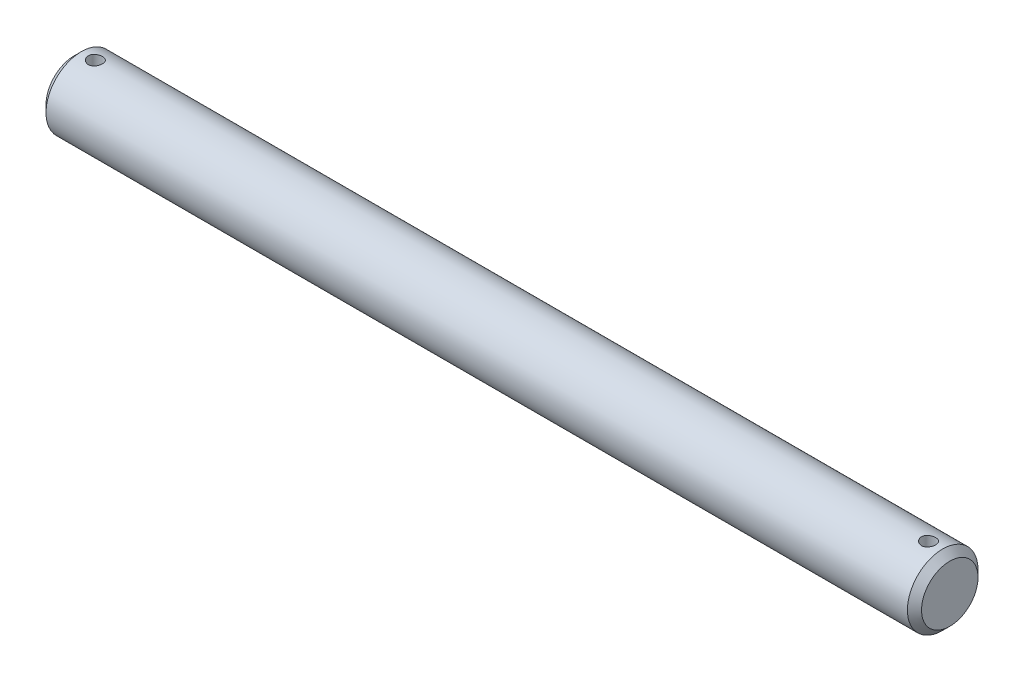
ISO-10303-21;
HEADER;
FILE_DESCRIPTION(('STEP AP214'),'2;1');
FILE_NAME('part.step','',(''),(''),'','','');
FILE_SCHEMA(('AUTOMOTIVE_DESIGN { 1 0 10303 214 1 1 1 1 }'));
ENDSEC;
DATA;
#1=APPLICATION_CONTEXT('core data for automotive mechanical design processes');
#2=APPLICATION_PROTOCOL_DEFINITION('international standard','automotive_design',2000,#1);
#3=PRODUCT_CONTEXT('',#1,'mechanical');
#4=PRODUCT('Part','Part','',(#3));
#5=PRODUCT_RELATED_PRODUCT_CATEGORY('part','',(#4));
#6=PRODUCT_DEFINITION_FORMATION('','',#4);
#7=PRODUCT_DEFINITION_CONTEXT('part definition',#1,'design');
#8=PRODUCT_DEFINITION('design','',#6,#7);
#9=PRODUCT_DEFINITION_SHAPE('','',#8);
#10=(LENGTH_UNIT() NAMED_UNIT(*) SI_UNIT(.MILLI.,.METRE.));
#11=(NAMED_UNIT(*) PLANE_ANGLE_UNIT() SI_UNIT($,.RADIAN.));
#12=(NAMED_UNIT(*) SI_UNIT($,.STERADIAN.) SOLID_ANGLE_UNIT());
#13=UNCERTAINTY_MEASURE_WITH_UNIT(LENGTH_MEASURE(1.E-05),#10,'distance_accuracy_value','');
#14=(GEOMETRIC_REPRESENTATION_CONTEXT(3) GLOBAL_UNCERTAINTY_ASSIGNED_CONTEXT((#13)) GLOBAL_UNIT_ASSIGNED_CONTEXT((#10,
#11,#12)) REPRESENTATION_CONTEXT('',''));
#15=CARTESIAN_POINT('',(0.,0.,0.));
#16=DIRECTION('',(0.,0.,1.));
#17=DIRECTION('',(1.,0.,0.));
#18=AXIS2_PLACEMENT_3D('',#15,#16,#17);
#19=CARTESIAN_POINT('',(1240.,0.,0.));
#20=DIRECTION('',(-1.,0.,0.));
#21=DIRECTION('',(0.,0.,1.));
#22=AXIS2_PLACEMENT_3D('',#19,#20,#21);
#23=CYLINDRICAL_SURFACE('',#22,50.);
#24=CARTESIAN_POINT('',(1230.,0.,0.));
#25=DIRECTION('',(1.,0.,0.));
#26=DIRECTION('',(0.,0.,-1.));
#27=AXIS2_PLACEMENT_3D('',#24,#25,#26);
#28=CIRCLE('',#27,50.);
#29=CARTESIAN_POINT('',(1230.,0.,-50.));
#30=VERTEX_POINT('',#29);
#31=EDGE_CURVE('E53',#30,#30,#28,.F.);
#32=ORIENTED_EDGE('',*,*,#31,.T.);
#33=EDGE_LOOP('',(#32));
#34=FACE_BOUND('',#33,.T.);
#35=CARTESIAN_POINT('',(10.,0.,0.));
#36=DIRECTION('',(1.,0.,0.));
#37=DIRECTION('',(0.,0.,-1.));
#38=AXIS2_PLACEMENT_3D('',#35,#36,#37);
#39=CIRCLE('',#38,50.);
#40=CARTESIAN_POINT('',(10.,0.,-50.));
#41=VERTEX_POINT('',#40);
#42=EDGE_CURVE('E58',#41,#41,#39,.T.);
#43=ORIENTED_EDGE('',*,*,#42,.T.);
#44=EDGE_LOOP('',(#43));
#45=FACE_BOUND('',#44,.T.);
#46=CARTESIAN_POINT('',(20.,-50.,0.));
#47=CARTESIAN_POINT('',(19.9999944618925,-50.0000028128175,0.277977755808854));
#48=CARTESIAN_POINT('',(20.011593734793,-49.9976778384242,0.555886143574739));
#49=CARTESIAN_POINT('',(20.0578879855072,-49.9884489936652,1.10977921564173));
#50=CARTESIAN_POINT('',(20.0925868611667,-49.9815443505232,1.38576356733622));
#51=CARTESIAN_POINT('',(20.1848451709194,-49.963338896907,1.93392208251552));
#52=CARTESIAN_POINT('',(20.2424203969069,-49.9520350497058,2.20609347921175));
#53=CARTESIAN_POINT('',(20.379977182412,-49.9253471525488,2.74451501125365));
#54=CARTESIAN_POINT('',(20.4599591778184,-49.9099630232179,3.01076503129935));
#55=CARTESIAN_POINT('',(20.6416238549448,-49.875557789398,3.53521359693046));
#56=CARTESIAN_POINT('',(20.7432850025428,-49.8565402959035,3.79341984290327));
#57=CARTESIAN_POINT('',(20.9675961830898,-49.8153808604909,4.30028962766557));
#58=CARTESIAN_POINT('',(21.0902464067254,-49.7932388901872,4.54895307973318));
#59=CARTESIAN_POINT('',(21.3556138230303,-49.7464407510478,5.03500105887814));
#60=CARTESIAN_POINT('',(21.4983261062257,-49.7217851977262,5.27238832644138));
#61=CARTESIAN_POINT('',(21.8028865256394,-49.6706164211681,5.73445047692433));
#62=CARTESIAN_POINT('',(21.9647409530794,-49.6441025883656,5.95912114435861));
#63=CARTESIAN_POINT('',(22.3084890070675,-49.5896179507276,6.39679707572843));
#64=CARTESIAN_POINT('',(22.490599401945,-49.5616335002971,6.60963041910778));
#65=CARTESIAN_POINT('',(22.8719972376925,-49.5052811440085,7.01925151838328));
#66=CARTESIAN_POINT('',(23.0712848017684,-49.4769132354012,7.21603915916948));
#67=CARTESIAN_POINT('',(23.485742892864,-49.4205766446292,7.59228605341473));
#68=CARTESIAN_POINT('',(23.7009174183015,-49.3926080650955,7.77174091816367));
#69=CARTESIAN_POINT('',(24.1455810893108,-49.3378715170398,8.11197405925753));
#70=CARTESIAN_POINT('',(24.3750652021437,-49.3111031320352,8.27275884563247));
#71=CARTESIAN_POINT('',(24.8490688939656,-49.2592741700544,8.57600136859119));
#72=CARTESIAN_POINT('',(25.0937084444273,-49.2342317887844,8.71827477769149));
#73=CARTESIAN_POINT('',(25.5943753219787,-49.1868624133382,8.98167482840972));
#74=CARTESIAN_POINT('',(25.8504027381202,-49.1645354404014,9.10280130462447));
#75=CARTESIAN_POINT('',(26.3720234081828,-49.1232596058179,9.32297805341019));
#76=CARTESIAN_POINT('',(26.6376159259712,-49.1043104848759,9.42203002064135));
#77=CARTESIAN_POINT('',(27.1764793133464,-49.0703574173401,9.59729126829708));
#78=CARTESIAN_POINT('',(27.4497500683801,-49.0553534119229,9.67350088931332));
#79=CARTESIAN_POINT('',(27.9983544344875,-49.0299142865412,9.80161813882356));
#80=CARTESIAN_POINT('',(28.2736140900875,-49.019421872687,9.85383113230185));
#81=CARTESIAN_POINT('',(28.8276783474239,-49.0030373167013,9.93499133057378));
#82=CARTESIAN_POINT('',(29.1064829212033,-48.9971451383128,9.96393871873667));
#83=CARTESIAN_POINT('',(29.6655728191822,-48.9901389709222,9.99832951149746));
#84=CARTESIAN_POINT('',(29.945858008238,-48.9890245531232,10.0037750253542));
#85=CARTESIAN_POINT('',(30.5058728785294,-48.9916064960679,9.99112280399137));
#86=CARTESIAN_POINT('',(30.7856025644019,-48.9953028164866,9.97302526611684));
#87=CARTESIAN_POINT('',(31.3382453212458,-49.0073028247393,9.91388721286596));
#88=CARTESIAN_POINT('',(31.6111975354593,-49.015536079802,9.87319735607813));
#89=CARTESIAN_POINT('',(32.1526452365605,-49.0363201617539,9.76944726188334));
#90=CARTESIAN_POINT('',(32.4211407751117,-49.0488709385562,9.70638728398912));
#91=CARTESIAN_POINT('',(32.9517693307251,-49.0779254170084,9.55839501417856));
#92=CARTESIAN_POINT('',(33.2139032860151,-49.0944285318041,9.47346596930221));
#93=CARTESIAN_POINT('',(33.7301547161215,-49.1309243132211,9.2823346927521));
#94=CARTESIAN_POINT('',(33.9842691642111,-49.1509182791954,9.17612453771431));
#95=CARTESIAN_POINT('',(34.484307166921,-49.193968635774,8.94246310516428));
#96=CARTESIAN_POINT('',(34.7301661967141,-49.2170442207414,8.81487730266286));
#97=CARTESIAN_POINT('',(35.2102964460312,-49.2655065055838,8.53986851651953));
#98=CARTESIAN_POINT('',(35.444567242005,-49.2908932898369,8.39244480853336));
#99=CARTESIAN_POINT('',(35.8999858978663,-49.3432736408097,8.07877597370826));
#100=CARTESIAN_POINT('',(36.1211327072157,-49.3702673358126,7.91252934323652));
#101=CARTESIAN_POINT('',(36.5488361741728,-49.4251177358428,7.56234993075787));
#102=CARTESIAN_POINT('',(36.7553926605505,-49.452974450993,7.37841694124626));
#103=CARTESIAN_POINT('',(37.1561418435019,-49.5092950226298,6.99062034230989));
#104=CARTESIAN_POINT('',(37.3500446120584,-49.5377607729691,6.78645727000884));
#105=CARTESIAN_POINT('',(37.7199888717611,-49.593999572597,6.36246248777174));
#106=CARTESIAN_POINT('',(37.8960306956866,-49.6217726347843,6.14263106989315));
#107=CARTESIAN_POINT('',(38.2290663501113,-49.6758545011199,5.68873593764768));
#108=CARTESIAN_POINT('',(38.386055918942,-49.7021629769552,5.45466905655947));
#109=CARTESIAN_POINT('',(38.6797603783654,-49.7525608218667,4.9740371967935));
#110=CARTESIAN_POINT('',(38.8164829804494,-49.7766510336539,4.72747701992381));
#111=CARTESIAN_POINT('',(39.0689406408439,-49.8219853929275,4.22303258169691));
#112=CARTESIAN_POINT('',(39.1846381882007,-49.8432244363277,3.96512908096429));
#113=CARTESIAN_POINT('',(39.393865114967,-49.8822025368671,3.44022135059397));
#114=CARTESIAN_POINT('',(39.4873944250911,-49.8999415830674,3.17321709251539));
#115=CARTESIAN_POINT('',(39.6515410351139,-49.9314104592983,2.63205201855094));
#116=CARTESIAN_POINT('',(39.7221605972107,-49.9451406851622,2.35789191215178));
#117=CARTESIAN_POINT('',(39.8399294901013,-49.9681986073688,1.80439488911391));
#118=CARTESIAN_POINT('',(39.8870791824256,-49.977526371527,1.52505805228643));
#119=CARTESIAN_POINT('',(39.9569319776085,-49.9913926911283,0.967980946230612));
#120=CARTESIAN_POINT('',(39.9800310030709,-49.996008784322,0.690292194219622));
#121=CARTESIAN_POINT('',(40.0029786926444,-50.0005945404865,0.133918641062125));
#122=CARTESIAN_POINT('',(40.0028276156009,-50.0005642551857,-0.144766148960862));
#123=CARTESIAN_POINT('',(39.9792772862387,-49.995858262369,-0.701096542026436));
#124=CARTESIAN_POINT('',(39.9558792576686,-49.991182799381,-0.978742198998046));
#125=CARTESIAN_POINT('',(39.8860254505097,-49.977318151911,-1.53100232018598));
#126=CARTESIAN_POINT('',(39.8395697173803,-49.968128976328,-1.80561679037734));
#127=CARTESIAN_POINT('',(39.724492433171,-49.9455964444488,-2.34739156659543));
#128=CARTESIAN_POINT('',(39.6560744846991,-49.9322912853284,-2.61459675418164));
#129=CARTESIAN_POINT('',(39.4974836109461,-49.9018651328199,-3.14224372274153));
#130=CARTESIAN_POINT('',(39.4073108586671,-49.8847441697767,-3.40268555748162));
#131=CARTESIAN_POINT('',(39.2058965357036,-49.8471538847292,-3.91499921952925));
#132=CARTESIAN_POINT('',(39.0946576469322,-49.8266849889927,-4.16687213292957));
#133=CARTESIAN_POINT('',(38.851865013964,-49.7829414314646,-4.66049012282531));
#134=CARTESIAN_POINT('',(38.7203035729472,-49.75966570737,-4.90223131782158));
#135=CARTESIAN_POINT('',(38.436150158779,-49.7106509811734,-5.37668428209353));
#136=CARTESIAN_POINT('',(38.2833278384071,-49.6848860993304,-5.60925542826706));
#137=CARTESIAN_POINT('',(37.9588612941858,-49.6318230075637,-6.06084706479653));
#138=CARTESIAN_POINT('',(37.7872085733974,-49.6045241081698,-6.27986136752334));
#139=CARTESIAN_POINT('',(37.4262932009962,-49.5491477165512,-6.70279490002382));
#140=CARTESIAN_POINT('',(37.2370288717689,-49.5210701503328,-6.9067126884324));
#141=CARTESIAN_POINT('',(36.8422624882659,-49.4649210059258,-7.29798916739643));
#142=CARTESIAN_POINT('',(36.6367676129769,-49.4368494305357,-7.48535510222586));
#143=CARTESIAN_POINT('',(36.2074878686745,-49.3810380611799,-7.84517391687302));
#144=CARTESIAN_POINT('',(35.9834668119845,-49.3533103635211,-8.01734702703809));
#145=CARTESIAN_POINT('',(35.5216201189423,-49.2994494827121,-8.34214485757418));
#146=CARTESIAN_POINT('',(35.2837996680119,-49.2733157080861,-8.4947768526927));
#147=CARTESIAN_POINT('',(34.7958689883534,-49.2233833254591,-8.77948955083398));
#148=CARTESIAN_POINT('',(34.5457567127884,-49.1995851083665,-8.91156681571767));
#149=CARTESIAN_POINT('',(34.035021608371,-49.1550271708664,-9.15415330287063));
#150=CARTESIAN_POINT('',(33.7743988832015,-49.1342674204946,-9.26466273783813));
#151=CARTESIAN_POINT('',(33.245877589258,-49.0965031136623,-9.46274286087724));
#152=CARTESIAN_POINT('',(32.9780243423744,-49.0794794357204,-9.5504308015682));
#153=CARTESIAN_POINT('',(32.435655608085,-49.049557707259,-9.70293434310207));
#154=CARTESIAN_POINT('',(32.1611401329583,-49.0366596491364,-9.76774998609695));
#155=CARTESIAN_POINT('',(31.6074750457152,-49.0153799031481,-9.87397956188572));
#156=CARTESIAN_POINT('',(31.3283259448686,-49.006997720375,-9.91539605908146));
#157=CARTESIAN_POINT('',(30.7674260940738,-48.9950031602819,-9.97449643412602));
#158=CARTESIAN_POINT('',(30.4856753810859,-48.9913907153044,-9.99218064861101));
#159=CARTESIAN_POINT('',(29.9267932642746,-48.9890670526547,-10.0035662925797));
#160=CARTESIAN_POINT('',(29.6496708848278,-48.9902680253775,-9.99769739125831));
#161=CARTESIAN_POINT('',(29.0969312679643,-48.9973383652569,-9.96298881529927));
#162=CARTESIAN_POINT('',(28.8213140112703,-49.0032076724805,-9.93414943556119));
#163=CARTESIAN_POINT('',(28.2735573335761,-49.0194416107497,-9.85373138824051));
#164=CARTESIAN_POINT('',(28.0014178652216,-49.0298061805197,-9.80215303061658));
#165=CARTESIAN_POINT('',(27.4625348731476,-49.0547273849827,-9.67666303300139));
#166=CARTESIAN_POINT('',(27.1957913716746,-49.0692840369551,-9.60275130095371));
#167=CARTESIAN_POINT('',(26.6702492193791,-49.1021245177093,-9.43338650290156));
#168=CARTESIAN_POINT('',(26.4114315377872,-49.1203984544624,-9.33799053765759));
#169=CARTESIAN_POINT('',(25.9026759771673,-49.1601842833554,-9.12621961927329));
#170=CARTESIAN_POINT('',(25.6527413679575,-49.1816973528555,-9.00983703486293));
#171=CARTESIAN_POINT('',(25.1635514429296,-49.2273493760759,-8.75697253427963));
#172=CARTESIAN_POINT('',(24.9242947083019,-49.2514879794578,-8.62049329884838));
#173=CARTESIAN_POINT('',(24.4579880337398,-49.3017256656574,-8.3283733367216));
#174=CARTESIAN_POINT('',(24.2309385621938,-49.3278248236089,-8.17273187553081));
#175=CARTESIAN_POINT('',(23.7867870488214,-49.3817232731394,-7.84054768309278));
#176=CARTESIAN_POINT('',(23.5699194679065,-49.4095439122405,-7.66369484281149));
#177=CARTESIAN_POINT('',(23.1517963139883,-49.465694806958,-7.29248007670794));
#178=CARTESIAN_POINT('',(22.9505409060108,-49.4940250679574,-7.09811796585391));
#179=CARTESIAN_POINT('',(22.5649520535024,-49.5504141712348,-6.69314940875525));
#180=CARTESIAN_POINT('',(22.3806226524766,-49.5784729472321,-6.48253910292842));
#181=CARTESIAN_POINT('',(22.0302035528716,-49.6335340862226,-6.04653350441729));
#182=CARTESIAN_POINT('',(21.8641134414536,-49.6605364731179,-5.82113854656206));
#183=CARTESIAN_POINT('',(21.5496521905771,-49.7130171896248,-5.35458685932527));
#184=CARTESIAN_POINT('',(21.401489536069,-49.7384761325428,-5.11328734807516));
#185=CARTESIAN_POINT('',(21.126111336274,-49.7868208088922,-4.61888962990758));
#186=CARTESIAN_POINT('',(20.9988880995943,-49.8097074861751,-4.36579579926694));
#187=CARTESIAN_POINT('',(20.7663509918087,-49.8522536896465,-3.84964665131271));
#188=CARTESIAN_POINT('',(20.6610238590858,-49.8719151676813,-3.5865974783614));
#189=CARTESIAN_POINT('',(20.4730246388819,-49.907462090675,-3.05236884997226));
#190=CARTESIAN_POINT('',(20.3903481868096,-49.9233482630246,-2.78119097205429));
#191=CARTESIAN_POINT('',(20.2135537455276,-49.957617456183,-2.09840431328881));
#192=CARTESIAN_POINT('',(20.1335803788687,-49.97342838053,-1.68291498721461));
#193=CARTESIAN_POINT('',(20.0268085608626,-49.9946173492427,-0.844896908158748));
#194=CARTESIAN_POINT('',(20.0000084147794,-49.9999957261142,-0.42236837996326));
#195=CARTESIAN_POINT('',(20.,-50.,0.));
#196=B_SPLINE_CURVE_WITH_KNOTS('',3,(#46,#47,#48,#49,#50,#51,#52,#53,#54,#55,#56,#57,#58,#59,
#60,#61,#62,#63,#64,#65,#66,#67,#68,#69,#70,#71,#72,#73,#74,#75,#76,#77,#78,#79,#80,#81,#82,#83,
#84,#85,#86,#87,#88,#89,#90,#91,#92,#93,#94,#95,#96,#97,#98,#99,#100,#101,#102,#103,#104,#105,
#106,#107,#108,#109,#110,#111,#112,#113,#114,#115,#116,#117,#118,#119,#120,#121,#122,#123,#124,
#125,#126,#127,#128,#129,#130,#131,#132,#133,#134,#135,#136,#137,#138,#139,#140,#141,#142,#143,
#144,#145,#146,#147,#148,#149,#150,#151,#152,#153,#154,#155,#156,#157,#158,#159,#160,#161,#162,
#163,#164,#165,#166,#167,#168,#169,#170,#171,#172,#173,#174,#175,#176,#177,#178,#179,#180,#181,
#182,#183,#184,#185,#186,#187,#188,#189,#190,#191,#192,#193,#194,#195),.UNSPECIFIED.,.T.,.F.,(4,
2,2,2,2,2,2,2,2,2,2,2,2,2,2,2,2,2,2,2,2,2,2,2,2,2,2,2,2,2,2,2,2,2,2,2,2,2,2,2,2,2,2,2,2,2,2,2,2,
2,2,2,2,2,2,2,2,2,2,2,2,2,2,2,2,2,2,2,2,2,2,2,2,2,4),(0.,0.833562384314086,1.66726546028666,
2.50154505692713,3.33584088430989,4.16931182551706,5.00279033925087,5.83606524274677,
6.66961477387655,7.51314652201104,8.35668432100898,9.20043514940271,10.0438908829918,
10.8951899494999,11.7464956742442,12.5977360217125,13.448963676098,14.2890369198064,
15.1291035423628,15.9690947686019,16.8090789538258,17.6363760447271,18.4636635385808,
19.2908282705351,20.1183015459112,20.9511927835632,21.7841144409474,22.6171026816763,
23.4501006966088,24.2981118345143,25.1461071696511,25.9942918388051,26.8421529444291,
27.6915121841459,28.5408740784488,29.3901520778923,30.2394169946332,31.0744689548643,
31.9095116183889,32.7445103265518,33.5795073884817,34.4069768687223,35.234439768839,
36.061797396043,36.8894691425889,37.7269307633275,38.564771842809,39.4026928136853,
40.2402452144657,41.0909250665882,41.9412873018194,42.7917916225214,43.6422875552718,
44.4883234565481,45.3343577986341,46.1802994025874,47.0262290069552,47.8567974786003,
48.687355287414,49.5179017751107,50.3484516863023,51.1768196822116,52.0054895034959,
52.8340488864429,53.6626400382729,54.5053049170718,55.3479787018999,56.1908532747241,
57.0337087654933,57.8855779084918,58.7371334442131,59.5881717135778,60.4390458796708,
61.7056278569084,62.9721694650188),.UNSPECIFIED.);
#197=CARTESIAN_POINT('',(20.,-50.,0.));
#198=VERTEX_POINT('',#197);
#199=EDGE_CURVE('E69',#198,#198,#196,.T.);
#200=ORIENTED_EDGE('',*,*,#199,.T.);
#201=EDGE_LOOP('',(#200));
#202=FACE_BOUND('',#201,.T.);
#203=CARTESIAN_POINT('',(30.,48.9897948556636,10.));
#204=CARTESIAN_POINT('',(29.7220847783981,48.9897918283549,10.0000055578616));
#205=CARTESIAN_POINT('',(29.4442389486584,48.9921641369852,9.98841144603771));
#206=CARTESIAN_POINT('',(28.8904726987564,49.0015764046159,9.94213833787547));
#207=CARTESIAN_POINT('',(28.6145526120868,49.0086171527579,9.90745543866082));
#208=CARTESIAN_POINT('',(28.0665239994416,49.0271684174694,9.81524081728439));
#209=CARTESIAN_POINT('',(27.7944182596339,49.0386820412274,9.75769321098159));
#210=CARTESIAN_POINT('',(27.256129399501,49.0658391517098,9.62020454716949));
#211=CARTESIAN_POINT('',(26.9899463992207,49.0814827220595,9.5402630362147));
#212=CARTESIAN_POINT('',(26.4656405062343,49.1164263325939,9.35869612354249));
#213=CARTESIAN_POINT('',(26.2075096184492,49.1357226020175,9.25709306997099));
#214=CARTESIAN_POINT('',(25.7007842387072,49.1774286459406,9.03291217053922));
#215=CARTESIAN_POINT('',(25.4521898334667,49.1998384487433,8.91033413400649));
#216=CARTESIAN_POINT('',(24.9662679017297,49.2471318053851,8.64512222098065));
#217=CARTESIAN_POINT('',(24.7289376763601,49.2720147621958,8.50249318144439));
#218=CARTESIAN_POINT('',(24.266974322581,49.323573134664,8.19810702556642));
#219=CARTESIAN_POINT('',(24.0423454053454,49.350249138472,8.03634361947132));
#220=CARTESIAN_POINT('',(23.6046146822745,49.4049916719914,7.69268740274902));
#221=CARTESIAN_POINT('',(23.3916925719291,49.4330714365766,7.51056777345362));
#222=CARTESIAN_POINT('',(22.9818930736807,49.4895203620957,7.12913276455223));
#223=CARTESIAN_POINT('',(22.7850157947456,49.5178895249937,6.92981726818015));
#224=CARTESIAN_POINT('',(22.408593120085,49.5741344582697,6.51528529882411));
#225=CARTESIAN_POINT('',(22.229051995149,49.6020101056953,6.30006493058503));
#226=CARTESIAN_POINT('',(21.8886527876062,49.6564771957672,5.85529185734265));
#227=CARTESIAN_POINT('',(21.727788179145,49.683069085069,5.62574420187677));
#228=CARTESIAN_POINT('',(21.4244535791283,49.7344693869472,5.15168816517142));
#229=CARTESIAN_POINT('',(21.2821604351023,49.7592597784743,4.90706461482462));
#230=CARTESIAN_POINT('',(21.018719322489,49.8060899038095,4.40642789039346));
#231=CARTESIAN_POINT('',(20.897571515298,49.8281296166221,4.15041462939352));
#232=CARTESIAN_POINT('',(20.6773513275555,49.8688285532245,3.62882259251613));
#233=CARTESIAN_POINT('',(20.5782773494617,49.8874880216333,3.3632445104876));
#234=CARTESIAN_POINT('',(20.4029717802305,49.9208928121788,2.82441379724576));
#235=CARTESIAN_POINT('',(20.3267398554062,49.9356381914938,2.55116127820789));
#236=CARTESIAN_POINT('',(20.1985813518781,49.9606235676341,2.00261735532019));
#237=CARTESIAN_POINT('',(20.1463477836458,49.9709203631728,1.72740024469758));
#238=CARTESIAN_POINT('',(20.0651400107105,49.9869968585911,1.17342458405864));
#239=CARTESIAN_POINT('',(20.0361656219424,49.9927765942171,0.894666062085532));
#240=CARTESIAN_POINT('',(20.0017132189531,49.9996545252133,0.335666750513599));
#241=CARTESIAN_POINT('',(19.9962332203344,50.0007531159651,0.0554260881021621));
#242=CARTESIAN_POINT('',(20.0088091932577,49.9982385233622,-0.504504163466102));
#243=CARTESIAN_POINT('',(20.0268649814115,49.9946253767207,-0.784193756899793));
#244=CARTESIAN_POINT('',(20.0859392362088,49.9828748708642,-1.33699925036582));
#245=CARTESIAN_POINT('',(20.1266264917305,49.9748027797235,-1.61015201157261));
#246=CARTESIAN_POINT('',(20.2304053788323,49.9544031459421,-2.15200203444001));
#247=CARTESIAN_POINT('',(20.2934967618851,49.9420756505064,-2.42069934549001));
#248=CARTESIAN_POINT('',(20.4415993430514,49.9135026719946,-2.95177475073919));
#249=CARTESIAN_POINT('',(20.5266111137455,49.8972570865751,-3.21415267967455));
#250=CARTESIAN_POINT('',(20.7179143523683,49.8612905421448,-3.73078612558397));
#251=CARTESIAN_POINT('',(20.8242060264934,49.8415695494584,-3.9850415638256));
#252=CARTESIAN_POINT('',(21.0580032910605,49.7990563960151,-4.48523963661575));
#253=CARTESIAN_POINT('',(21.1856344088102,49.7762462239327,-4.73112205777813));
#254=CARTESIAN_POINT('',(21.4607838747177,49.7282601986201,-5.21137268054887));
#255=CARTESIAN_POINT('',(21.6083096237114,49.7030834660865,-5.44573655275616));
#256=CARTESIAN_POINT('',(21.9221337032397,49.6510623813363,-5.90123233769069));
#257=CARTESIAN_POINT('',(22.0884261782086,49.6242185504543,-6.12236834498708));
#258=CARTESIAN_POINT('',(22.4387698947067,49.5695698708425,-6.55013490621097));
#259=CARTESIAN_POINT('',(22.6228292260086,49.5417645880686,-6.7567587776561));
#260=CARTESIAN_POINT('',(23.0107764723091,49.4854704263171,-7.1575050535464));
#261=CARTESIAN_POINT('',(23.2149543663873,49.4569780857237,-7.35134636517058));
#262=CARTESIAN_POINT('',(23.6388745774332,49.4006054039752,-7.72108497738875));
#263=CARTESIAN_POINT('',(23.8586099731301,49.3727247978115,-7.89699017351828));
#264=CARTESIAN_POINT('',(24.3123383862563,49.3183409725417,-8.2298054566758));
#265=CARTESIAN_POINT('',(24.5463376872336,49.2918383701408,-8.38670707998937));
#266=CARTESIAN_POINT('',(25.0268183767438,49.2409940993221,-8.68024711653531));
#267=CARTESIAN_POINT('',(25.2732948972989,49.2166515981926,-8.81689335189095));
#268=CARTESIAN_POINT('',(25.7777103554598,49.1707688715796,-9.0692882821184));
#269=CARTESIAN_POINT('',(26.03567490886,49.1492353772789,-9.18498702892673));
#270=CARTESIAN_POINT('',(26.5607102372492,49.1096752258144,-9.39420797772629));
#271=CARTESIAN_POINT('',(26.8277810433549,49.0916485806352,-9.48773010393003));
#272=CARTESIAN_POINT('',(27.3690835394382,49.0596447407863,-9.65185242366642));
#273=CARTESIAN_POINT('',(27.6433144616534,49.045667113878,-9.72245506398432));
#274=CARTESIAN_POINT('',(28.19695846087,49.0221835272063,-9.84017948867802));
#275=CARTESIAN_POINT('',(28.476371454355,49.0126774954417,-9.88730165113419));
#276=CARTESIAN_POINT('',(29.0334938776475,48.9985501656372,-9.95707419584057));
#277=CARTESIAN_POINT('',(29.3111505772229,48.9938480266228,-9.98012972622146));
#278=CARTESIAN_POINT('',(29.8674579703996,48.9891846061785,-10.0029960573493));
#279=CARTESIAN_POINT('',(30.1461086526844,48.9892232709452,-10.0028071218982));
#280=CARTESIAN_POINT('',(30.7023660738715,48.9940401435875,-9.97918703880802));
#281=CARTESIAN_POINT('',(30.9799728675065,48.9988180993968,-9.95575712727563));
#282=CARTESIAN_POINT('',(31.5321487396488,49.0129707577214,-9.88584676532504));
#283=CARTESIAN_POINT('',(31.8067178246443,49.0223454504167,-9.8393663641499));
#284=CARTESIAN_POINT('',(32.3482322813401,49.0453026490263,-9.72428351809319));
#285=CARTESIAN_POINT('',(32.6152255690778,49.0588438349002,-9.65589804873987));
#286=CARTESIAN_POINT('',(33.14245270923,49.0897723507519,-9.49740821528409));
#287=CARTESIAN_POINT('',(33.4026866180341,49.1071596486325,-9.40730403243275));
#288=CARTESIAN_POINT('',(33.9145966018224,49.1452837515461,-9.20606122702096));
#289=CARTESIAN_POINT('',(34.1662737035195,49.1660201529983,-9.09492513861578));
#290=CARTESIAN_POINT('',(34.6595173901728,49.2102706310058,-8.85237024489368));
#291=CARTESIAN_POINT('',(34.901080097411,49.2337857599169,-8.72094374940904));
#292=CARTESIAN_POINT('',(35.3753852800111,49.2832469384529,-8.43697778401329));
#293=CARTESIAN_POINT('',(35.6079779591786,49.3092199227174,-8.28419278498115));
#294=CARTESIAN_POINT('',(36.0596206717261,49.3626243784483,-7.95979509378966));
#295=CARTESIAN_POINT('',(36.278664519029,49.3900565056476,-7.78817389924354));
#296=CARTESIAN_POINT('',(36.7016649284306,49.4456098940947,-7.42731319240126));
#297=CARTESIAN_POINT('',(36.9056201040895,49.4737312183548,-7.23807206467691));
#298=CARTESIAN_POINT('',(37.2969785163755,49.5298738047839,-6.84334094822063));
#299=CARTESIAN_POINT('',(37.4843890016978,49.5578951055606,-6.63785815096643));
#300=CARTESIAN_POINT('',(37.8443242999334,49.6135193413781,-6.20856421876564));
#301=CARTESIAN_POINT('',(38.0165671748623,49.6411086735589,-5.98451481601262));
#302=CARTESIAN_POINT('',(38.3415002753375,49.694616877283,-5.52259730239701));
#303=CARTESIAN_POINT('',(38.4941977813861,49.7205363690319,-5.28473438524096));
#304=CARTESIAN_POINT('',(38.7790330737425,49.7699883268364,-4.7967087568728));
#305=CARTESIAN_POINT('',(38.911167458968,49.7935203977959,-4.54654401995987));
#306=CARTESIAN_POINT('',(39.153857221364,49.8375245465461,-4.03569830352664));
#307=CARTESIAN_POINT('',(39.2644128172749,49.8579966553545,-3.7750174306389));
#308=CARTESIAN_POINT('',(39.4625229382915,49.8951893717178,-3.24651230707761));
#309=CARTESIAN_POINT('',(39.5502059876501,49.9119308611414,-2.97873771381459));
#310=CARTESIAN_POINT('',(39.7027114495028,49.941335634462,-2.43653422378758));
#311=CARTESIAN_POINT('',(39.7675339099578,49.9539989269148,-2.16210534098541));
#312=CARTESIAN_POINT('',(39.8737911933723,49.9748840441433,-1.60861716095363));
#313=CARTESIAN_POINT('',(39.91522837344,49.9831063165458,-1.32955833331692));
#314=CARTESIAN_POINT('',(39.974384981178,49.9948748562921,-0.768841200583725));
#315=CARTESIAN_POINT('',(39.9921047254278,49.9984211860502,-0.487182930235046));
#316=CARTESIAN_POINT('',(40.0035803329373,50.0007159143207,0.0717276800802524));
#317=CARTESIAN_POINT('',(39.9977482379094,49.999546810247,0.348971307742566));
#318=CARTESIAN_POINT('',(39.9630928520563,49.9926287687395,0.901957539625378));
#319=CARTESIAN_POINT('',(39.9342698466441,49.9868798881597,1.17770016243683));
#320=CARTESIAN_POINT('',(39.8538631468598,49.970962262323,1.72571035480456));
#321=CARTESIAN_POINT('',(39.8022798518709,49.9607935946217,1.99797798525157));
#322=CARTESIAN_POINT('',(39.6767574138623,49.9363179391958,2.53711927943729));
#323=CARTESIAN_POINT('',(39.6028181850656,49.9220109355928,2.80399292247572));
#324=CARTESIAN_POINT('',(39.4333626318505,49.8896926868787,3.32983299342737));
#325=CARTESIAN_POINT('',(39.3379002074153,49.8716907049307,3.58881737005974));
#326=CARTESIAN_POINT('',(39.1259678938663,49.8324437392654,4.09789680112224));
#327=CARTESIAN_POINT('',(39.0094903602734,49.8111975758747,4.34798858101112));
#328=CARTESIAN_POINT('',(38.7564108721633,49.7660450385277,4.83747566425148));
#329=CARTESIAN_POINT('',(38.6198116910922,49.7421390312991,5.07687243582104));
#330=CARTESIAN_POINT('',(38.3274306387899,49.6923068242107,5.54343723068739));
#331=CARTESIAN_POINT('',(38.171648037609,49.6663805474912,5.77060478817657));
#332=CARTESIAN_POINT('',(37.8393047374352,49.6127743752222,6.21477842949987));
#333=CARTESIAN_POINT('',(37.6624494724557,49.5850729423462,6.43156156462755));
#334=CARTESIAN_POINT('',(37.2912474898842,49.5290685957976,6.84951320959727));
#335=CARTESIAN_POINT('',(37.0969005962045,49.500765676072,7.05068156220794));
#336=CARTESIAN_POINT('',(36.6919800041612,49.4443364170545,7.43609764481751));
#337=CARTESIAN_POINT('',(36.4814023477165,49.4162101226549,7.62034122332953));
#338=CARTESIAN_POINT('',(36.0454799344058,49.3609268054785,7.97059269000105));
#339=CARTESIAN_POINT('',(35.8201355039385,49.3337697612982,8.13660098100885));
#340=CARTESIAN_POINT('',(35.3536296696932,49.2808996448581,8.45095402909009));
#341=CARTESIAN_POINT('',(35.1123215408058,49.2552057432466,8.59908439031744));
#342=CARTESIAN_POINT('',(34.6179110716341,49.2063472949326,8.87439761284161));
#343=CARTESIAN_POINT('',(34.3648131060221,49.1831818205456,9.0015881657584));
#344=CARTESIAN_POINT('',(33.8486577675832,49.1400662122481,9.23406088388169));
#345=CARTESIAN_POINT('',(33.5856065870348,49.1201141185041,9.33935641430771));
#346=CARTESIAN_POINT('',(33.0513720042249,49.0840074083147,9.52729445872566));
#347=CARTESIAN_POINT('',(32.7801901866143,49.0678520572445,9.60994135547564));
#348=CARTESIAN_POINT('',(32.0975646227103,49.0329882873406,9.78661834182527));
#349=CARTESIAN_POINT('',(31.6822440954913,49.0168802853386,9.86652673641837));
#350=CARTESIAN_POINT('',(30.8445621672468,48.9952860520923,9.97321242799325));
#351=CARTESIAN_POINT('',(30.4222010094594,48.989799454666,9.99999155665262));
#352=CARTESIAN_POINT('',(30.,48.9897948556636,10.));
#353=B_SPLINE_CURVE_WITH_KNOTS('',3,(#203,#204,#205,#206,#207,#208,#209,#210,#211,#212,#213,
#214,#215,#216,#217,#218,#219,#220,#221,#222,#223,#224,#225,#226,#227,#228,#229,#230,#231,#232,
#233,#234,#235,#236,#237,#238,#239,#240,#241,#242,#243,#244,#245,#246,#247,#248,#249,#250,#251,
#252,#253,#254,#255,#256,#257,#258,#259,#260,#261,#262,#263,#264,#265,#266,#267,#268,#269,#270,
#271,#272,#273,#274,#275,#276,#277,#278,#279,#280,#281,#282,#283,#284,#285,#286,#287,#288,#289,
#290,#291,#292,#293,#294,#295,#296,#297,#298,#299,#300,#301,#302,#303,#304,#305,#306,#307,#308,
#309,#310,#311,#312,#313,#314,#315,#316,#317,#318,#319,#320,#321,#322,#323,#324,#325,#326,#327,
#328,#329,#330,#331,#332,#333,#334,#335,#336,#337,#338,#339,#340,#341,#342,#343,#344,#345,#346,
#347,#348,#349,#350,#351,#352),.UNSPECIFIED.,.T.,.F.,(4,2,2,2,2,2,2,2,2,2,2,2,2,2,2,2,2,2,2,2,2,
2,2,2,2,2,2,2,2,2,2,2,2,2,2,2,2,2,2,2,2,2,2,2,2,2,2,2,2,2,2,2,2,2,2,2,2,2,2,2,2,2,2,2,2,2,2,2,2,
2,2,2,2,2,4),(0.,0.833374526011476,1.66688995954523,2.50098545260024,3.33509783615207,
4.16835379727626,5.00161733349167,5.83468020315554,6.66801767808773,7.51179657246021,
8.35558119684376,9.19957316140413,10.0432693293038,10.8944900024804,11.7457171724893,
12.596882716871,13.4480358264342,14.2879750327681,15.1279075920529,15.9677692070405,
16.8076242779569,17.6354997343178,18.4633660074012,19.2912539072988,20.1191498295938,
20.9520991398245,21.7853591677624,22.6183599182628,23.4517417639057,24.2996671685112,
25.1472176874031,25.9951443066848,26.842742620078,27.6923361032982,28.5419324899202,
29.3914381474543,30.240930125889,31.075878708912,31.9108178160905,32.7457125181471,
33.5806054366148,34.4074717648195,35.2343311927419,36.0610910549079,36.8881650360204,
37.7256773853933,38.5635693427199,39.4015381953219,40.2391380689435,41.0899703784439,
41.9404848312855,42.7911398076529,43.641786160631,44.4875442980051,45.3333006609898,
46.1789717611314,47.0246315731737,47.855561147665,48.6864804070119,49.5173850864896,
50.348292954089,51.1771426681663,52.0062944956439,52.8353321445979,53.6644013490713,
54.5068406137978,55.3492883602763,56.1919422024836,57.0345774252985,57.886482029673,
58.7380730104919,59.5891426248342,60.4400474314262,61.7061302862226,62.9721694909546),.UNSPECIFIED.);
#354=CARTESIAN_POINT('',(30.,48.9897948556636,10.));
#355=VERTEX_POINT('',#354);
#356=EDGE_CURVE('E78',#355,#355,#353,.T.);
#357=ORIENTED_EDGE('',*,*,#356,.T.);
#358=EDGE_LOOP('',(#357));
#359=FACE_BOUND('',#358,.T.);
#360=CARTESIAN_POINT('',(1200.,-50.,0.));
#361=CARTESIAN_POINT('',(1199.99999446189,-50.0000028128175,0.277977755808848));
#362=CARTESIAN_POINT('',(1200.01159373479,-49.9976778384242,0.555886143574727));
#363=CARTESIAN_POINT('',(1200.05788798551,-49.9884489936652,1.10977921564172));
#364=CARTESIAN_POINT('',(1200.09258686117,-49.9815443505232,1.38576356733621));
#365=CARTESIAN_POINT('',(1200.18484517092,-49.963338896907,1.93392208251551));
#366=CARTESIAN_POINT('',(1200.24242039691,-49.9520350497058,2.20609347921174));
#367=CARTESIAN_POINT('',(1200.37997718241,-49.9253471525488,2.74451501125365));
#368=CARTESIAN_POINT('',(1200.45995917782,-49.9099630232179,3.01076503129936));
#369=CARTESIAN_POINT('',(1200.64162385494,-49.875557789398,3.53521359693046));
#370=CARTESIAN_POINT('',(1200.74328500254,-49.8565402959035,3.79341984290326));
#371=CARTESIAN_POINT('',(1200.96759618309,-49.8153808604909,4.30028962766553));
#372=CARTESIAN_POINT('',(1201.09024640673,-49.7932388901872,4.54895307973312));
#373=CARTESIAN_POINT('',(1201.35561382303,-49.7464407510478,5.03500105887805));
#374=CARTESIAN_POINT('',(1201.49832610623,-49.7217851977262,5.27238832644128));
#375=CARTESIAN_POINT('',(1201.80288652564,-49.6706164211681,5.73445047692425));
#376=CARTESIAN_POINT('',(1201.96474095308,-49.6441025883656,5.95912114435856));
#377=CARTESIAN_POINT('',(1202.30848900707,-49.5896179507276,6.39679707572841));
#378=CARTESIAN_POINT('',(1202.49059940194,-49.5616335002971,6.60963041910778));
#379=CARTESIAN_POINT('',(1202.87199723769,-49.5052811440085,7.01925151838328));
#380=CARTESIAN_POINT('',(1203.07128480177,-49.4769132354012,7.21603915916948));
#381=CARTESIAN_POINT('',(1203.48574289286,-49.4205766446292,7.59228605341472));
#382=CARTESIAN_POINT('',(1203.7009174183,-49.3926080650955,7.77174091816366));
#383=CARTESIAN_POINT('',(1204.14558108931,-49.3378715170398,8.11197405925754));
#384=CARTESIAN_POINT('',(1204.37506520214,-49.3111031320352,8.27275884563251));
#385=CARTESIAN_POINT('',(1204.84906889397,-49.2592741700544,8.57600136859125));
#386=CARTESIAN_POINT('',(1205.09370844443,-49.2342317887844,8.71827477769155));
#387=CARTESIAN_POINT('',(1205.59437532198,-49.1868624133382,8.9816748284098));
#388=CARTESIAN_POINT('',(1205.85040273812,-49.1645354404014,9.10280130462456));
#389=CARTESIAN_POINT('',(1206.37202340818,-49.1232596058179,9.32297805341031));
#390=CARTESIAN_POINT('',(1206.63761592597,-49.1043104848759,9.42203002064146));
#391=CARTESIAN_POINT('',(1207.17647931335,-49.0703574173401,9.59729126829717));
#392=CARTESIAN_POINT('',(1207.44975006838,-49.0553534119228,9.67350088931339));
#393=CARTESIAN_POINT('',(1207.99835443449,-49.0299142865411,9.80161813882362));
#394=CARTESIAN_POINT('',(1208.27361409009,-49.019421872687,9.85383113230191));
#395=CARTESIAN_POINT('',(1208.82767834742,-49.0030373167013,9.93499133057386));
#396=CARTESIAN_POINT('',(1209.1064829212,-48.9971451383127,9.96393871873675));
#397=CARTESIAN_POINT('',(1209.66557281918,-48.9901389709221,9.99832951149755));
#398=CARTESIAN_POINT('',(1209.94585800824,-48.9890245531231,10.0037750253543));
#399=CARTESIAN_POINT('',(1210.50587287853,-48.9916064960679,9.99112280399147));
#400=CARTESIAN_POINT('',(1210.7856025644,-48.9953028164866,9.97302526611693));
#401=CARTESIAN_POINT('',(1211.33824532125,-49.0073028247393,9.91388721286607));
#402=CARTESIAN_POINT('',(1211.61119753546,-49.015536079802,9.87319735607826));
#403=CARTESIAN_POINT('',(1212.15264523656,-49.0363201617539,9.76944726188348));
#404=CARTESIAN_POINT('',(1212.42114077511,-49.0488709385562,9.70638728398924));
#405=CARTESIAN_POINT('',(1212.95176933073,-49.0779254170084,9.55839501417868));
#406=CARTESIAN_POINT('',(1213.21390328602,-49.0944285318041,9.47346596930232));
#407=CARTESIAN_POINT('',(1213.73015471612,-49.1309243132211,9.2823346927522));
#408=CARTESIAN_POINT('',(1213.98426916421,-49.1509182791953,9.17612453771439));
#409=CARTESIAN_POINT('',(1214.48430716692,-49.193968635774,8.9424631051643));
#410=CARTESIAN_POINT('',(1214.73016619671,-49.2170442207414,8.81487730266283));
#411=CARTESIAN_POINT('',(1215.21029644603,-49.2655065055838,8.53986851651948));
#412=CARTESIAN_POINT('',(1215.44456724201,-49.2908932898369,8.39244480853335));
#413=CARTESIAN_POINT('',(1215.89998589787,-49.3432736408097,8.07877597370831));
#414=CARTESIAN_POINT('',(1216.12113270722,-49.3702673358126,7.91252934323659));
#415=CARTESIAN_POINT('',(1216.54883617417,-49.4251177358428,7.56234993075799));
#416=CARTESIAN_POINT('',(1216.75539266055,-49.4529744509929,7.3784169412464));
#417=CARTESIAN_POINT('',(1217.1561418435,-49.5092950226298,6.99062034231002));
#418=CARTESIAN_POINT('',(1217.35004461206,-49.5377607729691,6.78645727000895));
#419=CARTESIAN_POINT('',(1217.71998887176,-49.593999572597,6.36246248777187));
#420=CARTESIAN_POINT('',(1217.89603069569,-49.6217726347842,6.14263106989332));
#421=CARTESIAN_POINT('',(1218.22906635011,-49.6758545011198,5.68873593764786));
#422=CARTESIAN_POINT('',(1218.38605591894,-49.7021629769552,5.45466905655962));
#423=CARTESIAN_POINT('',(1218.67976037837,-49.7525608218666,4.97403719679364));
#424=CARTESIAN_POINT('',(1218.81648298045,-49.7766510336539,4.72747701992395));
#425=CARTESIAN_POINT('',(1219.06894064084,-49.8219853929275,4.22303258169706));
#426=CARTESIAN_POINT('',(1219.1846381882,-49.8432244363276,3.96512908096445));
#427=CARTESIAN_POINT('',(1219.39386511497,-49.8822025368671,3.44022135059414));
#428=CARTESIAN_POINT('',(1219.48739442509,-49.8999415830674,3.17321709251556));
#429=CARTESIAN_POINT('',(1219.65154103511,-49.9314104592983,2.63205201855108));
#430=CARTESIAN_POINT('',(1219.72216059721,-49.9451406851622,2.35789191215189));
#431=CARTESIAN_POINT('',(1219.8399294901,-49.9681986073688,1.80439488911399));
#432=CARTESIAN_POINT('',(1219.88707918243,-49.977526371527,1.52505805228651));
#433=CARTESIAN_POINT('',(1219.95693197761,-49.9913926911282,0.967980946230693));
#434=CARTESIAN_POINT('',(1219.98003100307,-49.996008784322,0.690292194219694));
#435=CARTESIAN_POINT('',(1220.00297869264,-50.0005945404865,0.133918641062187));
#436=CARTESIAN_POINT('',(1220.0028276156,-50.0005642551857,-0.1447661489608));
#437=CARTESIAN_POINT('',(1219.97927728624,-49.995858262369,-0.701096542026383));
#438=CARTESIAN_POINT('',(1219.95587925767,-49.991182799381,-0.978742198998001));
#439=CARTESIAN_POINT('',(1219.88602545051,-49.977318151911,-1.53100232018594));
#440=CARTESIAN_POINT('',(1219.83956971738,-49.968128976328,-1.8056167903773));
#441=CARTESIAN_POINT('',(1219.72449243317,-49.9455964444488,-2.3473915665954));
#442=CARTESIAN_POINT('',(1219.6560744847,-49.9322912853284,-2.61459675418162));
#443=CARTESIAN_POINT('',(1219.49748361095,-49.9018651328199,-3.14224372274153));
#444=CARTESIAN_POINT('',(1219.40731085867,-49.8847441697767,-3.40268555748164));
#445=CARTESIAN_POINT('',(1219.2058965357,-49.8471538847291,-3.91499921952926));
#446=CARTESIAN_POINT('',(1219.09465764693,-49.8266849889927,-4.16687213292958));
#447=CARTESIAN_POINT('',(1218.85186501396,-49.7829414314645,-4.66049012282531));
#448=CARTESIAN_POINT('',(1218.72030357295,-49.75966570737,-4.90223131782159));
#449=CARTESIAN_POINT('',(1218.43615015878,-49.7106509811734,-5.37668428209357));
#450=CARTESIAN_POINT('',(1218.28332783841,-49.6848860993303,-5.60925542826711));
#451=CARTESIAN_POINT('',(1217.95886129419,-49.6318230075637,-6.06084706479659));
#452=CARTESIAN_POINT('',(1217.7872085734,-49.6045241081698,-6.27986136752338));
#453=CARTESIAN_POINT('',(1217.426293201,-49.5491477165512,-6.70279490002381));
#454=CARTESIAN_POINT('',(1217.23702887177,-49.5210701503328,-6.90671268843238));
#455=CARTESIAN_POINT('',(1216.84226248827,-49.4649210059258,-7.2979891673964));
#456=CARTESIAN_POINT('',(1216.63676761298,-49.4368494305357,-7.48535510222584));
#457=CARTESIAN_POINT('',(1216.20748786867,-49.3810380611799,-7.84517391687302));
#458=CARTESIAN_POINT('',(1215.98346681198,-49.3533103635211,-8.01734702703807));
#459=CARTESIAN_POINT('',(1215.52162011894,-49.2994494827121,-8.34214485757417));
#460=CARTESIAN_POINT('',(1215.28379966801,-49.2733157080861,-8.4947768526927));
#461=CARTESIAN_POINT('',(1214.79586898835,-49.2233833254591,-8.77948955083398));
#462=CARTESIAN_POINT('',(1214.54575671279,-49.1995851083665,-8.91156681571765));
#463=CARTESIAN_POINT('',(1214.03502160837,-49.1550271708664,-9.15415330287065));
#464=CARTESIAN_POINT('',(1213.7743988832,-49.1342674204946,-9.2646627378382));
#465=CARTESIAN_POINT('',(1213.24587758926,-49.0965031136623,-9.46274286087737));
#466=CARTESIAN_POINT('',(1212.97802434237,-49.0794794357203,-9.55043080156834));
#467=CARTESIAN_POINT('',(1212.43565560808,-49.049557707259,-9.70293434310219));
#468=CARTESIAN_POINT('',(1212.16114013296,-49.0366596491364,-9.76774998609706));
#469=CARTESIAN_POINT('',(1211.60747504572,-49.0153799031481,-9.87397956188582));
#470=CARTESIAN_POINT('',(1211.32832594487,-49.0069977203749,-9.91539605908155));
#471=CARTESIAN_POINT('',(1210.76742609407,-48.9950031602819,-9.9744964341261));
#472=CARTESIAN_POINT('',(1210.48567538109,-48.9913907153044,-9.9921806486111));
#473=CARTESIAN_POINT('',(1209.92679326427,-48.9890670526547,-10.0035662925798));
#474=CARTESIAN_POINT('',(1209.64967088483,-48.9902680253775,-9.9976973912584));
#475=CARTESIAN_POINT('',(1209.09693126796,-48.9973383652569,-9.96298881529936));
#476=CARTESIAN_POINT('',(1208.82131401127,-49.0032076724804,-9.93414943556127));
#477=CARTESIAN_POINT('',(1208.27355733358,-49.0194416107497,-9.85373138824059));
#478=CARTESIAN_POINT('',(1208.00141786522,-49.0298061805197,-9.80215303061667));
#479=CARTESIAN_POINT('',(1207.46253487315,-49.0547273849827,-9.6766630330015));
#480=CARTESIAN_POINT('',(1207.19579137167,-49.0692840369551,-9.60275130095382));
#481=CARTESIAN_POINT('',(1206.67024921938,-49.1021245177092,-9.43338650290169));
#482=CARTESIAN_POINT('',(1206.41143153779,-49.1203984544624,-9.33799053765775));
#483=CARTESIAN_POINT('',(1205.90267597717,-49.1601842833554,-9.12621961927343));
#484=CARTESIAN_POINT('',(1205.65274136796,-49.1816973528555,-9.00983703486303));
#485=CARTESIAN_POINT('',(1205.16355144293,-49.2273493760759,-8.75697253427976));
#486=CARTESIAN_POINT('',(1204.9242947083,-49.2514879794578,-8.62049329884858));
#487=CARTESIAN_POINT('',(1204.45798803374,-49.3017256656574,-8.32837333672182));
#488=CARTESIAN_POINT('',(1204.23093856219,-49.3278248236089,-8.17273187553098));
#489=CARTESIAN_POINT('',(1203.78678704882,-49.3817232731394,-7.84054768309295));
#490=CARTESIAN_POINT('',(1203.56991946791,-49.4095439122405,-7.66369484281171));
#491=CARTESIAN_POINT('',(1203.15179631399,-49.465694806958,-7.29248007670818));
#492=CARTESIAN_POINT('',(1202.95054090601,-49.4940250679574,-7.0981179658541));
#493=CARTESIAN_POINT('',(1202.5649520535,-49.5504141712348,-6.69314940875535));
#494=CARTESIAN_POINT('',(1202.38062265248,-49.5784729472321,-6.48253910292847));
#495=CARTESIAN_POINT('',(1202.03020355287,-49.6335340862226,-6.04653350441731));
#496=CARTESIAN_POINT('',(1201.86411344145,-49.6605364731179,-5.8211385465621));
#497=CARTESIAN_POINT('',(1201.54965219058,-49.7130171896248,-5.35458685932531));
#498=CARTESIAN_POINT('',(1201.40148953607,-49.7384761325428,-5.1132873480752));
#499=CARTESIAN_POINT('',(1201.12611133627,-49.7868208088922,-4.61888962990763));
#500=CARTESIAN_POINT('',(1200.99888809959,-49.8097074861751,-4.36579579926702));
#501=CARTESIAN_POINT('',(1200.76635099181,-49.8522536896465,-3.84964665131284));
#502=CARTESIAN_POINT('',(1200.66102385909,-49.8719151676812,-3.58659747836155));
#503=CARTESIAN_POINT('',(1200.47302463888,-49.907462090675,-3.05236884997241));
#504=CARTESIAN_POINT('',(1200.39034818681,-49.9233482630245,-2.78119097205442));
#505=CARTESIAN_POINT('',(1200.21355374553,-49.957617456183,-2.09840431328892));
#506=CARTESIAN_POINT('',(1200.13358037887,-49.97342838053,-1.68291498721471));
#507=CARTESIAN_POINT('',(1200.02680856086,-49.9946173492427,-0.844896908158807));
#508=CARTESIAN_POINT('',(1200.00000841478,-49.9999957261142,-0.422368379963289));
#509=CARTESIAN_POINT('',(1200.,-50.,0.));
#510=B_SPLINE_CURVE_WITH_KNOTS('',3,(#360,#361,#362,#363,#364,#365,#366,#367,#368,#369,#370,
#371,#372,#373,#374,#375,#376,#377,#378,#379,#380,#381,#382,#383,#384,#385,#386,#387,#388,#389,
#390,#391,#392,#393,#394,#395,#396,#397,#398,#399,#400,#401,#402,#403,#404,#405,#406,#407,#408,
#409,#410,#411,#412,#413,#414,#415,#416,#417,#418,#419,#420,#421,#422,#423,#424,#425,#426,#427,
#428,#429,#430,#431,#432,#433,#434,#435,#436,#437,#438,#439,#440,#441,#442,#443,#444,#445,#446,
#447,#448,#449,#450,#451,#452,#453,#454,#455,#456,#457,#458,#459,#460,#461,#462,#463,#464,#465,
#466,#467,#468,#469,#470,#471,#472,#473,#474,#475,#476,#477,#478,#479,#480,#481,#482,#483,#484,
#485,#486,#487,#488,#489,#490,#491,#492,#493,#494,#495,#496,#497,#498,#499,#500,#501,#502,#503,
#504,#505,#506,#507,#508,#509),.UNSPECIFIED.,.T.,.F.,(4,2,2,2,2,2,2,2,2,2,2,2,2,2,2,2,2,2,2,2,2,
2,2,2,2,2,2,2,2,2,2,2,2,2,2,2,2,2,2,2,2,2,2,2,2,2,2,2,2,2,2,2,2,2,2,2,2,2,2,2,2,2,2,2,2,2,2,2,2,
2,2,2,2,2,4),(0.,0.833562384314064,1.66726546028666,2.50154505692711,3.3358408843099,
4.16931182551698,5.00279033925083,5.83606524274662,6.66961477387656,7.51314652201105,
8.35668432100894,9.20043514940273,10.0438908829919,10.8951899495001,11.7464956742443,
12.5977360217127,13.4489636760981,14.2890369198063,15.1291035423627,15.9690947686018,
16.8090789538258,17.6363760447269,18.4636635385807,19.2908282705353,20.1183015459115,
20.9511927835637,21.7841144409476,22.6171026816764,23.4501006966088,24.2981118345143,
25.1461071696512,25.9942918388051,26.8421529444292,27.6915121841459,28.5408740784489,
29.3901520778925,30.2394169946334,31.0744689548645,31.9095116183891,32.744510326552,
33.5795073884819,34.4069768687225,35.2344397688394,36.0617973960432,36.8894691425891,
37.7269307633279,38.5647718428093,39.4026928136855,40.240245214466,41.0909250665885,
41.9412873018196,42.7917916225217,43.6422875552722,44.4883234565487,45.3343577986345,
46.1802994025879,47.0262290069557,47.8567974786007,48.6873552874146,49.5179017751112,
50.3484516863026,51.176819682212,52.0054895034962,52.8340488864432,53.6626400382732,
54.505304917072,55.3479787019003,56.1908532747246,57.0337087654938,57.8855779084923,
58.7371334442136,59.5881717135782,60.4390458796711,61.7056278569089,62.9721694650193),.UNSPECIFIED.);
#511=CARTESIAN_POINT('',(1200.,-50.,0.));
#512=VERTEX_POINT('',#511);
#513=EDGE_CURVE('E105',#512,#512,#510,.T.);
#514=ORIENTED_EDGE('',*,*,#513,.T.);
#515=EDGE_LOOP('',(#514));
#516=FACE_BOUND('',#515,.T.);
#517=CARTESIAN_POINT('',(1210.,48.9897948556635,10.0000000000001));
#518=CARTESIAN_POINT('',(1209.7220847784,48.9897918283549,10.0000055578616));
#519=CARTESIAN_POINT('',(1209.44423894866,48.9921641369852,9.9884114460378));
#520=CARTESIAN_POINT('',(1208.89047269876,49.0015764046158,9.94213833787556));
#521=CARTESIAN_POINT('',(1208.61455261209,49.0086171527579,9.9074554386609));
#522=CARTESIAN_POINT('',(1208.06652399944,49.0271684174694,9.81524081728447));
#523=CARTESIAN_POINT('',(1207.79441825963,49.0386820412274,9.75769321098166));
#524=CARTESIAN_POINT('',(1207.2561293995,49.0658391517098,9.62020454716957));
#525=CARTESIAN_POINT('',(1206.98994639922,49.0814827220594,9.54026303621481));
#526=CARTESIAN_POINT('',(1206.46564050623,49.1164263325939,9.35869612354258));
#527=CARTESIAN_POINT('',(1206.20750961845,49.1357226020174,9.25709306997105));
#528=CARTESIAN_POINT('',(1205.70078423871,49.1774286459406,9.03291217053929));
#529=CARTESIAN_POINT('',(1205.45218983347,49.1998384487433,8.91033413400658));
#530=CARTESIAN_POINT('',(1204.96626790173,49.2471318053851,8.64512222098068));
#531=CARTESIAN_POINT('',(1204.72893767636,49.2720147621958,8.50249318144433));
#532=CARTESIAN_POINT('',(1204.26697432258,49.323573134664,8.19810702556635));
#533=CARTESIAN_POINT('',(1204.04234540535,49.350249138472,8.03634361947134));
#534=CARTESIAN_POINT('',(1203.60461468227,49.4049916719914,7.69268740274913));
#535=CARTESIAN_POINT('',(1203.39169257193,49.4330714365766,7.51056777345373));
#536=CARTESIAN_POINT('',(1202.98189307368,49.4895203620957,7.12913276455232));
#537=CARTESIAN_POINT('',(1202.78501579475,49.5178895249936,6.92981726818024));
#538=CARTESIAN_POINT('',(1202.40859312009,49.5741344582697,6.5152852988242));
#539=CARTESIAN_POINT('',(1202.22905199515,49.6020101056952,6.30006493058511));
#540=CARTESIAN_POINT('',(1201.88865278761,49.6564771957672,5.85529185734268));
#541=CARTESIAN_POINT('',(1201.72778817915,49.683069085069,5.62574420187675));
#542=CARTESIAN_POINT('',(1201.42445357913,49.7344693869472,5.15168816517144));
#543=CARTESIAN_POINT('',(1201.2821604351,49.7592597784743,4.90706461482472));
#544=CARTESIAN_POINT('',(1201.01871932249,49.8060899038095,4.40642789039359));
#545=CARTESIAN_POINT('',(1200.8975715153,49.8281296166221,4.15041462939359));
#546=CARTESIAN_POINT('',(1200.67735132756,49.8688285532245,3.62882259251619));
#547=CARTESIAN_POINT('',(1200.57827734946,49.8874880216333,3.3632445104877));
#548=CARTESIAN_POINT('',(1200.40297178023,49.9208928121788,2.8244137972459));
#549=CARTESIAN_POINT('',(1200.32673985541,49.9356381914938,2.55116127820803));
#550=CARTESIAN_POINT('',(1200.19858135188,49.9606235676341,2.00261735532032));
#551=CARTESIAN_POINT('',(1200.14634778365,49.9709203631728,1.7274002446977));
#552=CARTESIAN_POINT('',(1200.06514001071,49.9869968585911,1.17342458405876));
#553=CARTESIAN_POINT('',(1200.03616562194,49.9927765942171,0.894666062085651));
#554=CARTESIAN_POINT('',(1200.00171321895,49.9996545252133,0.335666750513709));
#555=CARTESIAN_POINT('',(1199.99623322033,50.0007531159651,0.0554260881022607));
#556=CARTESIAN_POINT('',(1200.00880919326,49.9982385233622,-0.504504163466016));
#557=CARTESIAN_POINT('',(1200.02686498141,49.9946253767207,-0.784193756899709));
#558=CARTESIAN_POINT('',(1200.08593923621,49.9828748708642,-1.33699925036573));
#559=CARTESIAN_POINT('',(1200.12662649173,49.9748027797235,-1.61015201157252));
#560=CARTESIAN_POINT('',(1200.23040537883,49.9544031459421,-2.15200203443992));
#561=CARTESIAN_POINT('',(1200.29349676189,49.9420756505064,-2.42069934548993));
#562=CARTESIAN_POINT('',(1200.44159934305,49.9135026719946,-2.9517747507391));
#563=CARTESIAN_POINT('',(1200.52661111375,49.8972570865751,-3.21415267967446));
#564=CARTESIAN_POINT('',(1200.71791435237,49.8612905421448,-3.73078612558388));
#565=CARTESIAN_POINT('',(1200.82420602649,49.8415695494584,-3.98504156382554));
#566=CARTESIAN_POINT('',(1201.05800329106,49.7990563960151,-4.48523963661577));
#567=CARTESIAN_POINT('',(1201.18563440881,49.7762462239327,-4.7311220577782));
#568=CARTESIAN_POINT('',(1201.46078387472,49.72826019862,-5.21137268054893));
#569=CARTESIAN_POINT('',(1201.60830962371,49.7030834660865,-5.44573655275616));
#570=CARTESIAN_POINT('',(1201.92213370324,49.6510623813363,-5.90123233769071));
#571=CARTESIAN_POINT('',(1202.08842617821,49.6242185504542,-6.12236834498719));
#572=CARTESIAN_POINT('',(1202.43876989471,49.5695698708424,-6.55013490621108));
#573=CARTESIAN_POINT('',(1202.62282922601,49.5417645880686,-6.75675877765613));
#574=CARTESIAN_POINT('',(1203.01077647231,49.4854704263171,-7.1575050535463));
#575=CARTESIAN_POINT('',(1203.21495436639,49.4569780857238,-7.35134636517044));
#576=CARTESIAN_POINT('',(1203.63887457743,49.4006054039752,-7.7210849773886));
#577=CARTESIAN_POINT('',(1203.85860997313,49.3727247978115,-7.89699017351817));
#578=CARTESIAN_POINT('',(1204.31233838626,49.3183409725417,-8.22980545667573));
#579=CARTESIAN_POINT('',(1204.54633768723,49.2918383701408,-8.38670707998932));
#580=CARTESIAN_POINT('',(1205.02681837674,49.2409940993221,-8.68024711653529));
#581=CARTESIAN_POINT('',(1205.2732948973,49.2166515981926,-8.81689335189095));
#582=CARTESIAN_POINT('',(1205.77771035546,49.1707688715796,-9.06928828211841));
#583=CARTESIAN_POINT('',(1206.03567490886,49.1492353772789,-9.18498702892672));
#584=CARTESIAN_POINT('',(1206.56071023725,49.1096752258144,-9.39420797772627));
#585=CARTESIAN_POINT('',(1206.82778104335,49.0916485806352,-9.48773010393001));
#586=CARTESIAN_POINT('',(1207.36908353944,49.0596447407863,-9.65185242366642));
#587=CARTESIAN_POINT('',(1207.64331446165,49.045667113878,-9.72245506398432));
#588=CARTESIAN_POINT('',(1208.19695846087,49.0221835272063,-9.84017948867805));
#589=CARTESIAN_POINT('',(1208.47637145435,49.0126774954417,-9.88730165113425));
#590=CARTESIAN_POINT('',(1209.03349387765,48.9985501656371,-9.95707419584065));
#591=CARTESIAN_POINT('',(1209.31115057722,48.9938480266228,-9.98012972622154));
#592=CARTESIAN_POINT('',(1209.8674579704,48.9891846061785,-10.0029960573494));
#593=CARTESIAN_POINT('',(1210.14610865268,48.9892232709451,-10.0028071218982));
#594=CARTESIAN_POINT('',(1210.70236607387,48.9940401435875,-9.97918703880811));
#595=CARTESIAN_POINT('',(1210.97997286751,48.9988180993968,-9.95575712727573));
#596=CARTESIAN_POINT('',(1211.53214873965,49.0129707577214,-9.88584676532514));
#597=CARTESIAN_POINT('',(1211.80671782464,49.0223454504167,-9.83936636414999));
#598=CARTESIAN_POINT('',(1212.34823228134,49.0453026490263,-9.72428351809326));
#599=CARTESIAN_POINT('',(1212.61522556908,49.0588438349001,-9.65589804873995));
#600=CARTESIAN_POINT('',(1213.14245270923,49.0897723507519,-9.49740821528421));
#601=CARTESIAN_POINT('',(1213.40268661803,49.1071596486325,-9.40730403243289));
#602=CARTESIAN_POINT('',(1213.91459660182,49.1452837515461,-9.20606122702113));
#603=CARTESIAN_POINT('',(1214.16627370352,49.1660201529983,-9.09492513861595));
#604=CARTESIAN_POINT('',(1214.65951739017,49.2102706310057,-8.85237024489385));
#605=CARTESIAN_POINT('',(1214.90108009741,49.2337857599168,-8.72094374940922));
#606=CARTESIAN_POINT('',(1215.37538528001,49.2832469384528,-8.4369777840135));
#607=CARTESIAN_POINT('',(1215.60797795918,49.3092199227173,-8.28419278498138));
#608=CARTESIAN_POINT('',(1216.05962067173,49.3626243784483,-7.95979509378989));
#609=CARTESIAN_POINT('',(1216.27866451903,49.3900565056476,-7.78817389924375));
#610=CARTESIAN_POINT('',(1216.70166492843,49.4456098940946,-7.42731319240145));
#611=CARTESIAN_POINT('',(1216.90562010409,49.4737312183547,-7.23807206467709));
#612=CARTESIAN_POINT('',(1217.29697851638,49.5298738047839,-6.84334094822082));
#613=CARTESIAN_POINT('',(1217.4843890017,49.5578951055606,-6.63785815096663));
#614=CARTESIAN_POINT('',(1217.84432429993,49.6135193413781,-6.20856421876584));
#615=CARTESIAN_POINT('',(1218.01656717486,49.6411086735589,-5.98451481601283));
#616=CARTESIAN_POINT('',(1218.34150027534,49.694616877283,-5.5225973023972));
#617=CARTESIAN_POINT('',(1218.49419778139,49.7205363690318,-5.28473438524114));
#618=CARTESIAN_POINT('',(1218.77903307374,49.7699883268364,-4.79670875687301));
#619=CARTESIAN_POINT('',(1218.91116745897,49.7935203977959,-4.5465440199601));
#620=CARTESIAN_POINT('',(1219.15385722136,49.837524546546,-4.03569830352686));
#621=CARTESIAN_POINT('',(1219.26441281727,49.8579966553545,-3.77501743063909));
#622=CARTESIAN_POINT('',(1219.46252293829,49.8951893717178,-3.24651230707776));
#623=CARTESIAN_POINT('',(1219.55020598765,49.9119308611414,-2.97873771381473));
#624=CARTESIAN_POINT('',(1219.7027114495,49.941335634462,-2.43653422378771));
#625=CARTESIAN_POINT('',(1219.76753390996,49.9539989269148,-2.16210534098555));
#626=CARTESIAN_POINT('',(1219.87379119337,49.9748840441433,-1.60861716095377));
#627=CARTESIAN_POINT('',(1219.91522837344,49.9831063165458,-1.32955833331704));
#628=CARTESIAN_POINT('',(1219.97438498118,49.9948748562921,-0.768841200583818));
#629=CARTESIAN_POINT('',(1219.99210472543,49.9984211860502,-0.487182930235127));
#630=CARTESIAN_POINT('',(1220.00358033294,50.0007159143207,0.0717276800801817));
#631=CARTESIAN_POINT('',(1219.99774823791,49.999546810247,0.348971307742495));
#632=CARTESIAN_POINT('',(1219.96309285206,49.9926287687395,0.901957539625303));
#633=CARTESIAN_POINT('',(1219.93426984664,49.9868798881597,1.17770016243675));
#634=CARTESIAN_POINT('',(1219.85386314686,49.970962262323,1.72571035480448));
#635=CARTESIAN_POINT('',(1219.80227985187,49.9607935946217,1.99797798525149));
#636=CARTESIAN_POINT('',(1219.67675741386,49.9363179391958,2.53711927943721));
#637=CARTESIAN_POINT('',(1219.60281818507,49.9220109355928,2.80399292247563));
#638=CARTESIAN_POINT('',(1219.43336263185,49.8896926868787,3.32983299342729));
#639=CARTESIAN_POINT('',(1219.33790020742,49.8716907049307,3.58881737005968));
#640=CARTESIAN_POINT('',(1219.12596789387,49.8324437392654,4.0978968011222));
#641=CARTESIAN_POINT('',(1219.00949036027,49.8111975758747,4.34798858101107));
#642=CARTESIAN_POINT('',(1218.75641087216,49.7660450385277,4.83747566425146));
#643=CARTESIAN_POINT('',(1218.61981169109,49.7421390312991,5.07687243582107));
#644=CARTESIAN_POINT('',(1218.32743063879,49.6923068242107,5.54343723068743));
#645=CARTESIAN_POINT('',(1218.17164803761,49.6663805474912,5.77060478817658));
#646=CARTESIAN_POINT('',(1217.83930473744,49.6127743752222,6.21477842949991));
#647=CARTESIAN_POINT('',(1217.66244947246,49.5850729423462,6.43156156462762));
#648=CARTESIAN_POINT('',(1217.29124748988,49.5290685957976,6.84951320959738));
#649=CARTESIAN_POINT('',(1217.0969005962,49.500765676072,7.05068156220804));
#650=CARTESIAN_POINT('',(1216.69198000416,49.4443364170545,7.43609764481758));
#651=CARTESIAN_POINT('',(1216.48140234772,49.4162101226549,7.62034122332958));
#652=CARTESIAN_POINT('',(1216.04547993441,49.3609268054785,7.97059269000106));
#653=CARTESIAN_POINT('',(1215.82013550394,49.3337697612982,8.13660098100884));
#654=CARTESIAN_POINT('',(1215.35362966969,49.2808996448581,8.45095402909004));
#655=CARTESIAN_POINT('',(1215.11232154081,49.2552057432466,8.59908439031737));
#656=CARTESIAN_POINT('',(1214.61791107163,49.2063472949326,8.87439761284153));
#657=CARTESIAN_POINT('',(1214.36481310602,49.1831818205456,9.00158816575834));
#658=CARTESIAN_POINT('',(1213.84865776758,49.1400662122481,9.23406088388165));
#659=CARTESIAN_POINT('',(1213.58560658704,49.120114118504,9.33935641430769));
#660=CARTESIAN_POINT('',(1213.05137200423,49.0840074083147,9.52729445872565));
#661=CARTESIAN_POINT('',(1212.78019018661,49.0678520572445,9.60994135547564));
#662=CARTESIAN_POINT('',(1212.09756462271,49.0329882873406,9.78661834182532));
#663=CARTESIAN_POINT('',(1211.68224409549,49.0168802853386,9.86652673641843));
#664=CARTESIAN_POINT('',(1210.84456216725,48.9952860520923,9.97321242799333));
#665=CARTESIAN_POINT('',(1210.42220100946,48.989799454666,9.99999155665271));
#666=CARTESIAN_POINT('',(1210.,48.9897948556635,10.0000000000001));
#667=B_SPLINE_CURVE_WITH_KNOTS('',3,(#517,#518,#519,#520,#521,#522,#523,#524,#525,#526,#527,
#528,#529,#530,#531,#532,#533,#534,#535,#536,#537,#538,#539,#540,#541,#542,#543,#544,#545,#546,
#547,#548,#549,#550,#551,#552,#553,#554,#555,#556,#557,#558,#559,#560,#561,#562,#563,#564,#565,
#566,#567,#568,#569,#570,#571,#572,#573,#574,#575,#576,#577,#578,#579,#580,#581,#582,#583,#584,
#585,#586,#587,#588,#589,#590,#591,#592,#593,#594,#595,#596,#597,#598,#599,#600,#601,#602,#603,
#604,#605,#606,#607,#608,#609,#610,#611,#612,#613,#614,#615,#616,#617,#618,#619,#620,#621,#622,
#623,#624,#625,#626,#627,#628,#629,#630,#631,#632,#633,#634,#635,#636,#637,#638,#639,#640,#641,
#642,#643,#644,#645,#646,#647,#648,#649,#650,#651,#652,#653,#654,#655,#656,#657,#658,#659,#660,
#661,#662,#663,#664,#665,#666),.UNSPECIFIED.,.T.,.F.,(4,2,2,2,2,2,2,2,2,2,2,2,2,2,2,2,2,2,2,2,2,
2,2,2,2,2,2,2,2,2,2,2,2,2,2,2,2,2,2,2,2,2,2,2,2,2,2,2,2,2,2,2,2,2,2,2,2,2,2,2,2,2,2,2,2,2,2,2,2,
2,2,2,2,2,4),(0.,0.833374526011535,1.66688995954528,2.50098545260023,3.33509783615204,
4.16835379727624,5.00161733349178,5.83468020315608,6.66801767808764,7.51179657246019,
8.35558119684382,9.1995731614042,10.0432693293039,10.8944900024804,11.7457171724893,
12.596882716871,13.4480358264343,14.2879750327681,15.127907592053,15.9677692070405,
16.807624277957,17.6354997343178,18.4633660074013,19.2912539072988,20.1191498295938,
20.9520991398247,21.7853591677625,22.6183599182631,23.4517417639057,24.299667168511,
25.1472176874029,25.9951443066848,26.8427426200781,27.6923361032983,28.54193248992,
29.3914381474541,30.2409301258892,31.0758787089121,31.9108178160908,32.7457125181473,
33.5806054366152,34.4074717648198,35.234331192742,36.061091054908,36.8881650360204,
37.7256773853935,38.56356934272,39.4015381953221,40.2391380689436,41.089970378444,
41.9404848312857,42.7911398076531,43.6417861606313,44.4875442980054,45.3333006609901,
46.1789717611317,47.0246315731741,47.8555611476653,48.6864804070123,49.5173850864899,
50.3482929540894,51.1771426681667,52.0062944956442,52.8353321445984,53.6644013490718,
54.5068406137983,55.3492883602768,56.1919422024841,57.0345774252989,57.8864820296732,
58.7380730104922,59.5891426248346,60.4400474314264,61.706130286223,62.9721694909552),.UNSPECIFIED.);
#668=CARTESIAN_POINT('',(1210.,48.9897948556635,10.0000000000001));
#669=VERTEX_POINT('',#668);
#670=EDGE_CURVE('E101',#669,#669,#667,.T.);
#671=ORIENTED_EDGE('',*,*,#670,.T.);
#672=EDGE_LOOP('',(#671));
#673=FACE_BOUND('',#672,.T.);
#674=ADVANCED_FACE('F44',(#34,#45,#202,#359,#516,#673),#23,.T.);
#675=CARTESIAN_POINT('',(1240.,0.,0.));
#676=DIRECTION('',(1.,0.,0.));
#677=DIRECTION('',(0.,0.,-1.));
#678=AXIS2_PLACEMENT_3D('',#675,#676,#677);
#679=PLANE('',#678);
#680=CARTESIAN_POINT('',(1240.,0.,0.));
#681=DIRECTION('',(1.,0.,0.));
#682=DIRECTION('',(0.,0.,-1.));
#683=AXIS2_PLACEMENT_3D('',#680,#681,#682);
#684=CIRCLE('',#683,40.0000000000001);
#685=CARTESIAN_POINT('',(1240.,0.,-40.0000000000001));
#686=VERTEX_POINT('',#685);
#687=EDGE_CURVE('E63',#686,#686,#684,.T.);
#688=ORIENTED_EDGE('',*,*,#687,.T.);
#689=EDGE_LOOP('',(#688));
#690=FACE_BOUND('',#689,.T.);
#691=ADVANCED_FACE('F98',(#690),#679,.T.);
#692=CARTESIAN_POINT('',(0.,0.,0.));
#693=DIRECTION('',(1.,0.,0.));
#694=DIRECTION('',(0.,0.,-1.));
#695=AXIS2_PLACEMENT_3D('',#692,#693,#694);
#696=PLANE('',#695);
#697=CARTESIAN_POINT('',(0.,0.,0.));
#698=DIRECTION('',(1.,0.,0.));
#699=DIRECTION('',(0.,0.,-1.));
#700=AXIS2_PLACEMENT_3D('',#697,#698,#699);
#701=CIRCLE('',#700,40.0000000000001);
#702=CARTESIAN_POINT('',(0.,0.,-40.0000000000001));
#703=VERTEX_POINT('',#702);
#704=EDGE_CURVE('E10',#703,#703,#701,.F.);
#705=ORIENTED_EDGE('',*,*,#704,.T.);
#706=EDGE_LOOP('',(#705));
#707=FACE_BOUND('',#706,.T.);
#708=ADVANCED_FACE('F96',(#707),#696,.F.);
#709=CARTESIAN_POINT('',(1210.,-50.,0.));
#710=DIRECTION('',(0.,1.,0.));
#711=DIRECTION('',(0.,0.,1.));
#712=AXIS2_PLACEMENT_3D('',#709,#710,#711);
#713=CYLINDRICAL_SURFACE('',#712,10.0000000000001);
#714=ORIENTED_EDGE('',*,*,#670,.F.);
#715=EDGE_LOOP('',(#714));
#716=FACE_BOUND('',#715,.T.);
#717=ORIENTED_EDGE('',*,*,#513,.F.);
#718=EDGE_LOOP('',(#717));
#719=FACE_BOUND('',#718,.T.);
#720=ADVANCED_FACE('F90',(#716,#719),#713,.F.);
#721=CARTESIAN_POINT('',(30.,-50.,0.));
#722=DIRECTION('',(0.,1.,0.));
#723=DIRECTION('',(0.,0.,1.));
#724=AXIS2_PLACEMENT_3D('',#721,#722,#723);
#725=CYLINDRICAL_SURFACE('',#724,10.);
#726=ORIENTED_EDGE('',*,*,#356,.F.);
#727=EDGE_LOOP('',(#726));
#728=FACE_BOUND('',#727,.T.);
#729=ORIENTED_EDGE('',*,*,#199,.F.);
#730=EDGE_LOOP('',(#729));
#731=FACE_BOUND('',#730,.T.);
#732=ADVANCED_FACE('F85',(#728,#731),#725,.F.);
#733=CARTESIAN_POINT('',(1240.,0.,0.));
#734=DIRECTION('',(-1.,0.,0.));
#735=DIRECTION('',(0.,0.,1.));
#736=AXIS2_PLACEMENT_3D('',#733,#734,#735);
#737=CONICAL_SURFACE('',#736,40.0000000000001,0.785398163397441);
#738=ORIENTED_EDGE('',*,*,#31,.F.);
#739=EDGE_LOOP('',(#738));
#740=FACE_BOUND('',#739,.T.);
#741=ORIENTED_EDGE('',*,*,#687,.F.);
#742=EDGE_LOOP('',(#741));
#743=FACE_BOUND('',#742,.T.);
#744=ADVANCED_FACE('F89',(#740,#743),#737,.T.);
#745=CARTESIAN_POINT('',(10.,0.,0.));
#746=DIRECTION('',(1.,0.,0.));
#747=DIRECTION('',(0.,0.,-1.));
#748=AXIS2_PLACEMENT_3D('',#745,#746,#747);
#749=CONICAL_SURFACE('',#748,50.,0.785398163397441);
#750=ORIENTED_EDGE('',*,*,#704,.F.);
#751=EDGE_LOOP('',(#750));
#752=FACE_BOUND('',#751,.T.);
#753=ORIENTED_EDGE('',*,*,#42,.F.);
#754=EDGE_LOOP('',(#753));
#755=FACE_BOUND('',#754,.T.);
#756=ADVANCED_FACE('F47',(#752,#755),#749,.T.);
#757=CLOSED_SHELL('',(#674,#691,#708,#720,#732,#744,#756));
#758=MANIFOLD_SOLID_BREP('B2',#757);
#759=ADVANCED_BREP_SHAPE_REPRESENTATION('',(#18,#758),#14);
#760=SHAPE_DEFINITION_REPRESENTATION(#9,#759);
ENDSEC;
END-ISO-10303-21;
